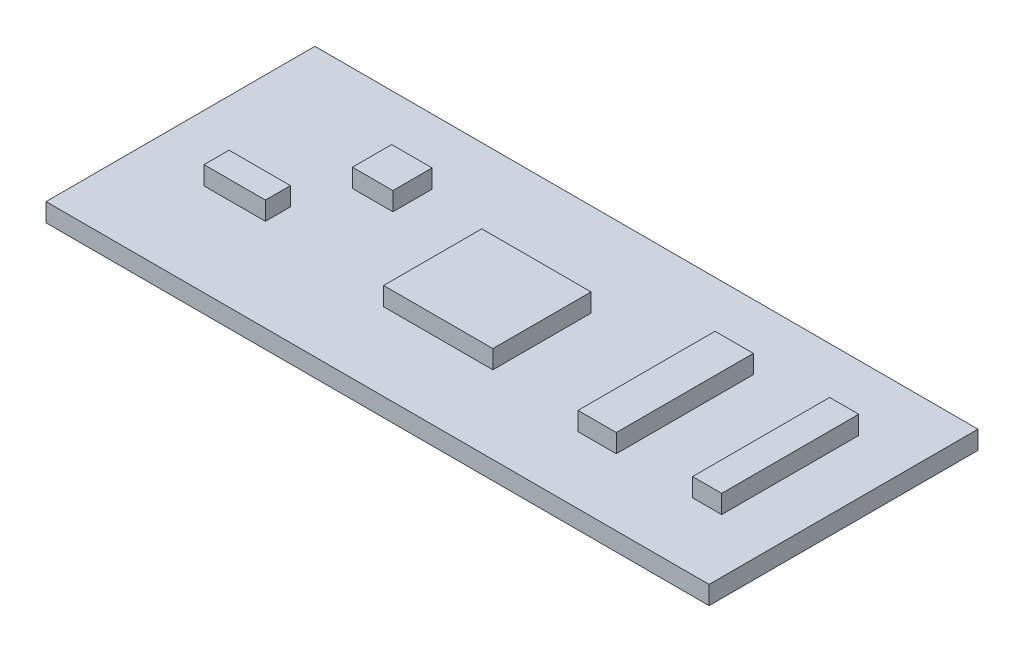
from build123d import *

# Parameters (mm, degrees)
SKETCH1_W           = 54
SKETCH1_H           = 1.5
BASE_EXTRUDE_DEPTH  = 21.9
SKETCH3_W           = 4.998311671
SKETCH3_H           = 2.03816217
SKETCH3_W_2         = 8.897477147
SKETCH3_H_2         = 7.992787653
SKETCH3_W_3         = 3.118341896
SKETCH3_H_3         = 11.160026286
SKETCH3_W_4         = 3.29494455
SKETCH3_H_4         = 3.19279051
SKETCH3_W_5         = 2.368291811
BOSS_EXTRUDE1_DEPTH = 1.5


with BuildPart() as part:
    # Sketch1 → Base-Extrude (new body)
    with BuildSketch(Plane.XY):
        with Locations((27, 0.75)):
            Rectangle(SKETCH1_W, SKETCH1_H)
    extrude(amount=-BASE_EXTRUDE_DEPTH)

    # Sketch3 → Boss-Extrude1 (add)
    with BuildSketch(Plane(origin=(0, 1.5, 0), x_dir=(-1, 0, 0), z_dir=(0, 1, 0))):
        with Locations((-7.827600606, -8.560633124)):
            Rectangle(SKETCH3_W, SKETCH3_H)
        with Locations((-25.613089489, -10.326489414)):
            Rectangle(SKETCH3_W_2, SKETCH3_H_2)
        with Locations((-39.449008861, -11.015862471)):
            Rectangle(SKETCH3_W_3, SKETCH3_H_3)
        with Locations((-13.199160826, -14.999480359)):
            Rectangle(SKETCH3_W_4, SKETCH3_H_4)
        with Locations((-48.405951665, -11.015862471)):
            Rectangle(SKETCH3_W_5, SKETCH3_H_3)
    extrude(amount=BOSS_EXTRUDE1_DEPTH)


solid = part.part
